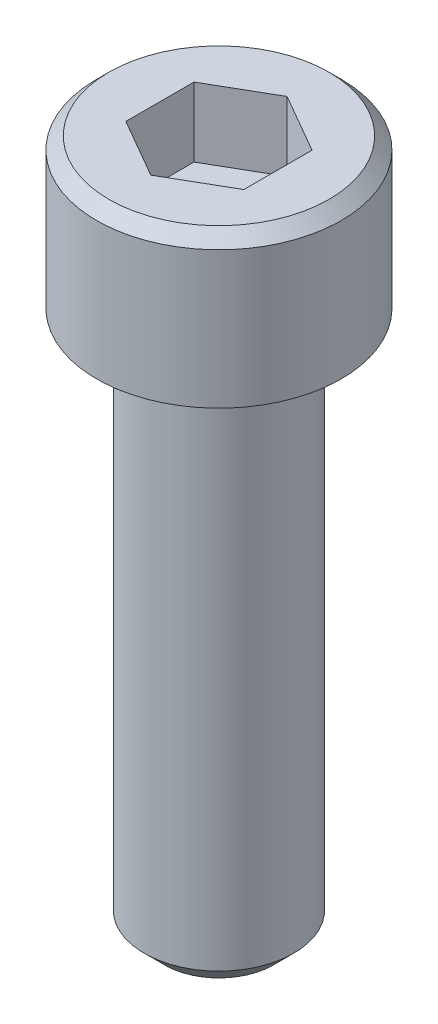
from build123d import *

# Parameters (mm, degrees)
CUT_EXTRUDE1_DEPTH = 1.6256


with BuildPart() as part:
    # Sketch1 → Base-Revolve (revolve)
    with BuildSketch(Plane.XY, mode=Mode.PRIVATE) as base_revolve_sk:
        Polygon((0, 0), (2.8702, 0), (2.8702, 3.21818), (2.58318, 3.5052), (0, 3.5052), align=None)
    revolve(base_revolve_sk.sketch.rotate(Axis((0, 0, 0), (0, 1, 0)), 90), axis=Axis((0, 0, 0), (0, 1, 0)))

    # Sketch2 → Boss-Revolve1 (revolve)
    with BuildSketch(Plane.XY, mode=Mode.PRIVATE) as boss_revolve1_sk:
        Polygon((0, -12.7), (1.28016, -12.7), (1.7526, -12.22756), (1.7526, 0), (0, 0), align=None)
    revolve(boss_revolve1_sk.sketch.rotate(Axis((0, 0, 0), (0, 1, 0)), 90), axis=Axis((0, 0, 0), (0, 1, 0)))

    # Sketch3 → Cut-Extrude1 (cut)
    with BuildSketch(Plane(origin=(0, 3.5052, 0), x_dir=(-1, 0, 0), z_dir=(0, 1, 0))):
        Polygon((1.3843, 0.799225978), (0, 1.598451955), (-1.3843, 0.799225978), (-1.3843, -0.799225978), (0, -1.598451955), (1.3843, -0.799225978), align=None)
    extrude(amount=-CUT_EXTRUDE1_DEPTH, mode=Mode.SUBTRACT)


solid = part.part
